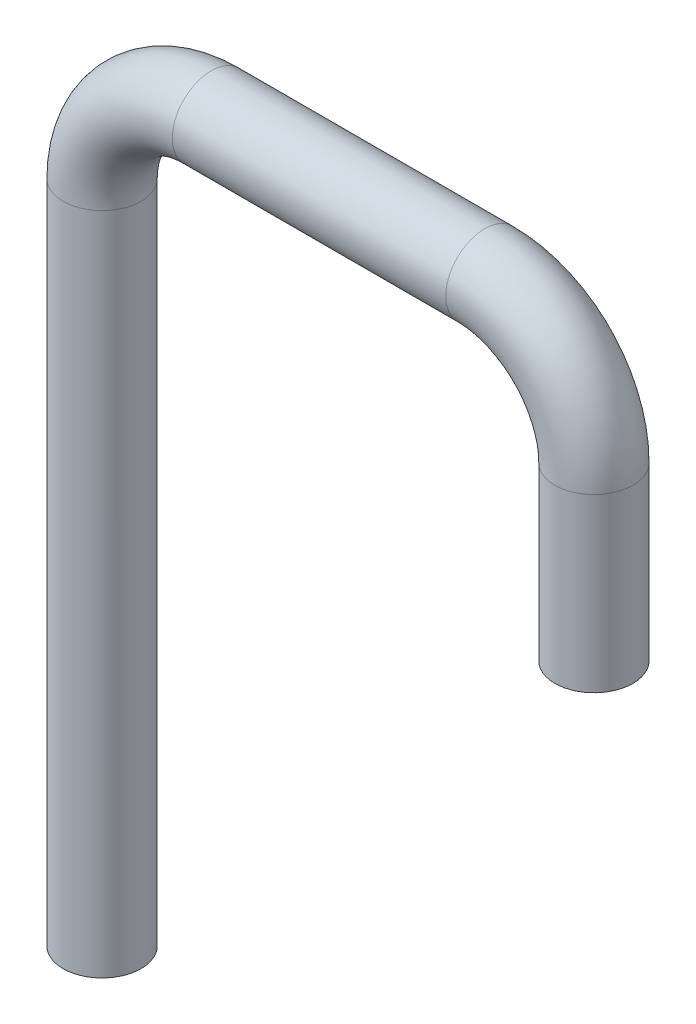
ISO-10303-21;
HEADER;
FILE_DESCRIPTION(('STEP AP214'),'2;1');
FILE_NAME('part.step','',(''),(''),'','','');
FILE_SCHEMA(('AUTOMOTIVE_DESIGN { 1 0 10303 214 1 1 1 1 }'));
ENDSEC;
DATA;
#1=APPLICATION_CONTEXT('core data for automotive mechanical design processes');
#2=APPLICATION_PROTOCOL_DEFINITION('international standard','automotive_design',2000,#1);
#3=PRODUCT_CONTEXT('',#1,'mechanical');
#4=PRODUCT('Part','Part','',(#3));
#5=PRODUCT_RELATED_PRODUCT_CATEGORY('part','',(#4));
#6=PRODUCT_DEFINITION_FORMATION('','',#4);
#7=PRODUCT_DEFINITION_CONTEXT('part definition',#1,'design');
#8=PRODUCT_DEFINITION('design','',#6,#7);
#9=PRODUCT_DEFINITION_SHAPE('','',#8);
#10=(LENGTH_UNIT() NAMED_UNIT(*) SI_UNIT(.MILLI.,.METRE.));
#11=(NAMED_UNIT(*) PLANE_ANGLE_UNIT() SI_UNIT($,.RADIAN.));
#12=(NAMED_UNIT(*) SI_UNIT($,.STERADIAN.) SOLID_ANGLE_UNIT());
#13=UNCERTAINTY_MEASURE_WITH_UNIT(LENGTH_MEASURE(1.E-05),#10,'distance_accuracy_value','');
#14=(GEOMETRIC_REPRESENTATION_CONTEXT(3) GLOBAL_UNCERTAINTY_ASSIGNED_CONTEXT((#13)) GLOBAL_UNIT_ASSIGNED_CONTEXT((#10,
#11,#12)) REPRESENTATION_CONTEXT('',''));
#15=CARTESIAN_POINT('',(0.,0.,0.));
#16=DIRECTION('',(0.,0.,1.));
#17=DIRECTION('',(1.,0.,0.));
#18=AXIS2_PLACEMENT_3D('',#15,#16,#17);
#19=CARTESIAN_POINT('',(40.0436780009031,54.102,0.));
#20=DIRECTION('',(0.,-1.,0.));
#21=DIRECTION('',(1.,0.,0.));
#22=AXIS2_PLACEMENT_3D('',#19,#20,#21);
#23=CYLINDRICAL_SURFACE('',#22,3.175);
#24=CARTESIAN_POINT('',(40.0436780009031,54.102,0.));
#25=DIRECTION('',(0.,-1.,0.));
#26=DIRECTION('',(1.,0.,0.));
#27=AXIS2_PLACEMENT_3D('',#24,#25,#26);
#28=CIRCLE('',#27,3.175);
#29=CARTESIAN_POINT('',(43.218678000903,54.102,-1.00118326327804E-13));
#30=VERTEX_POINT('',#29);
#31=EDGE_CURVE('E36',#30,#30,#28,.T.);
#32=ORIENTED_EDGE('',*,*,#31,.T.);
#33=EDGE_LOOP('',(#32));
#34=FACE_BOUND('',#33,.T.);
#35=CARTESIAN_POINT('',(40.0436780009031,40.132,-1.11022302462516E-13));
#36=DIRECTION('',(0.,-1.,0.));
#37=DIRECTION('',(1.,0.,0.));
#38=AXIS2_PLACEMENT_3D('',#35,#36,#37);
#39=CIRCLE('',#38,3.175);
#40=CARTESIAN_POINT('',(43.2186780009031,40.132,-1.09347947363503E-13));
#41=VERTEX_POINT('',#40);
#42=EDGE_CURVE('E10',#41,#41,#39,.T.);
#43=ORIENTED_EDGE('',*,*,#42,.F.);
#44=EDGE_LOOP('',(#43));
#45=FACE_BOUND('',#44,.T.);
#46=ADVANCED_FACE('F28',(#34,#45),#23,.T.);
#47=CARTESIAN_POINT('',(31.153678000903,54.102,0.));
#48=DIRECTION('',(0.,0.,-0.999999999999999));
#49=DIRECTION('',(-1.,0.,0.));
#50=AXIS2_PLACEMENT_3D('',#47,#48,#49);
#51=TOROIDAL_SURFACE('',#50,8.89000000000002,3.175);
#52=CARTESIAN_POINT('',(31.153678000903,62.992,0.));
#53=DIRECTION('',(-1.,0.,0.));
#54=DIRECTION('',(0.,-1.,0.));
#55=AXIS2_PLACEMENT_3D('',#52,#53,#54);
#56=CIRCLE('',#55,3.175);
#57=CARTESIAN_POINT('',(31.153678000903,66.167,-1.00118326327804E-13));
#58=VERTEX_POINT('',#57);
#59=EDGE_CURVE('E40',#58,#58,#56,.F.);
#60=CARTESIAN_POINT('',(31.153678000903,54.102,0.));
#61=DIRECTION('',(0.,0.,-0.999999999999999));
#62=DIRECTION('',(-1.,0.,0.));
#63=AXIS2_PLACEMENT_3D('',#60,#61,#62);
#64=CIRCLE('',#63,12.065);
#65=EDGE_CURVE('',#58,#30,#64,.T.);
#66=ORIENTED_EDGE('',*,*,#59,.T.);
#67=ORIENTED_EDGE('',*,*,#31,.F.);
#68=ORIENTED_EDGE('',*,*,#65,.T.);
#69=ORIENTED_EDGE('',*,*,#65,.F.);
#70=EDGE_LOOP('',(#66,#68,#67,#69));
#71=FACE_BOUND('',#70,.T.);
#72=ADVANCED_FACE('F110',(#71),#51,.T.);
#73=CARTESIAN_POINT('',(8.88999999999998,62.992,0.));
#74=DIRECTION('',(1.,0.,0.));
#75=DIRECTION('',(0.,1.,0.));
#76=AXIS2_PLACEMENT_3D('',#73,#74,#75);
#77=CYLINDRICAL_SURFACE('',#76,3.175);
#78=CARTESIAN_POINT('',(8.88999999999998,62.992,0.));
#79=DIRECTION('',(1.,0.,0.));
#80=DIRECTION('',(0.,1.,0.));
#81=AXIS2_PLACEMENT_3D('',#78,#79,#80);
#82=CIRCLE('',#81,3.175);
#83=CARTESIAN_POINT('',(8.88999999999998,66.167,0.));
#84=VERTEX_POINT('',#83);
#85=EDGE_CURVE('E46',#84,#84,#82,.T.);
#86=ORIENTED_EDGE('',*,*,#85,.T.);
#87=EDGE_LOOP('',(#86));
#88=FACE_BOUND('',#87,.T.);
#89=ORIENTED_EDGE('',*,*,#59,.F.);
#90=EDGE_LOOP('',(#89));
#91=FACE_BOUND('',#90,.T.);
#92=ADVANCED_FACE('F116',(#88,#91),#77,.T.);
#93=CARTESIAN_POINT('',(8.88999999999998,54.102,0.));
#94=DIRECTION('',(0.,0.,-0.999999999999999));
#95=DIRECTION('',(-1.,0.,0.));
#96=AXIS2_PLACEMENT_3D('',#93,#94,#95);
#97=TOROIDAL_SURFACE('',#96,8.89,3.175);
#98=CARTESIAN_POINT('',(0.,54.102,0.));
#99=DIRECTION('',(0.,-1.,0.));
#100=DIRECTION('',(0.,0.,-0.999999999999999));
#101=AXIS2_PLACEMENT_3D('',#98,#99,#100);
#102=CIRCLE('',#101,3.175);
#103=CARTESIAN_POINT('',(-3.17500000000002,54.102,0.));
#104=VERTEX_POINT('',#103);
#105=EDGE_CURVE('E43',#104,#104,#102,.F.);
#106=CARTESIAN_POINT('',(8.88999999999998,54.102,0.));
#107=DIRECTION('',(0.,0.,-0.999999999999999));
#108=DIRECTION('',(-1.,0.,0.));
#109=AXIS2_PLACEMENT_3D('',#106,#107,#108);
#110=CIRCLE('',#109,12.065);
#111=EDGE_CURVE('',#104,#84,#110,.T.);
#112=ORIENTED_EDGE('',*,*,#105,.T.);
#113=ORIENTED_EDGE('',*,*,#85,.F.);
#114=ORIENTED_EDGE('',*,*,#111,.T.);
#115=ORIENTED_EDGE('',*,*,#111,.F.);
#116=EDGE_LOOP('',(#112,#114,#113,#115));
#117=FACE_BOUND('',#116,.T.);
#118=ADVANCED_FACE('F107',(#117),#97,.T.);
#119=CARTESIAN_POINT('',(0.,54.102,0.));
#120=DIRECTION('',(0.,-1.,0.));
#121=DIRECTION('',(0.,0.,-0.999999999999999));
#122=AXIS2_PLACEMENT_3D('',#119,#120,#121);
#123=CYLINDRICAL_SURFACE('',#122,3.175);
#124=ORIENTED_EDGE('',*,*,#105,.F.);
#125=EDGE_LOOP('',(#124));
#126=FACE_BOUND('',#125,.T.);
#127=CARTESIAN_POINT('',(0.,0.,0.));
#128=DIRECTION('',(0.,1.,0.));
#129=DIRECTION('',(0.,0.,0.999999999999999));
#130=AXIS2_PLACEMENT_3D('',#127,#128,#129);
#131=CIRCLE('',#130,3.175);
#132=CARTESIAN_POINT('',(0.,0.,3.175));
#133=VERTEX_POINT('',#132);
#134=EDGE_CURVE('E32',#133,#133,#131,.T.);
#135=ORIENTED_EDGE('',*,*,#134,.T.);
#136=EDGE_LOOP('',(#135));
#137=FACE_BOUND('',#136,.T.);
#138=ADVANCED_FACE('F30',(#126,#137),#123,.T.);
#139=CARTESIAN_POINT('',(40.0436780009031,40.132,-1.11022302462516E-13));
#140=DIRECTION('',(0.,-1.,0.));
#141=DIRECTION('',(0.,0.,0.999999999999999));
#142=AXIS2_PLACEMENT_3D('',#139,#140,#141);
#143=PLANE('',#142);
#144=CARTESIAN_POINT('',(40.0436780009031,40.132,-1.11022302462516E-13));
#145=DIRECTION('',(0.,-1.,0.));
#146=DIRECTION('',(0.,0.,0.999999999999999));
#147=AXIS2_PLACEMENT_3D('',#144,#145,#146);
#148=CIRCLE('',#147,2.286);
#149=CARTESIAN_POINT('',(40.0436780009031,40.132,2.28599999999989));
#150=VERTEX_POINT('',#149);
#151=EDGE_CURVE('E51',#150,#150,#148,.T.);
#152=ORIENTED_EDGE('',*,*,#151,.F.);
#153=EDGE_LOOP('',(#152));
#154=FACE_BOUND('',#153,.T.);
#155=ORIENTED_EDGE('',*,*,#42,.T.);
#156=EDGE_LOOP('',(#155));
#157=FACE_BOUND('',#156,.T.);
#158=ADVANCED_FACE('F98',(#154,#157),#143,.T.);
#159=CARTESIAN_POINT('',(0.,0.,0.));
#160=DIRECTION('',(0.,1.,0.));
#161=DIRECTION('',(0.,0.,0.999999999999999));
#162=AXIS2_PLACEMENT_3D('',#159,#160,#161);
#163=PLANE('',#162);
#164=CARTESIAN_POINT('',(0.,0.,0.));
#165=DIRECTION('',(0.,1.,0.));
#166=DIRECTION('',(0.,0.,0.999999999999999));
#167=AXIS2_PLACEMENT_3D('',#164,#165,#166);
#168=CIRCLE('',#167,2.286);
#169=CARTESIAN_POINT('',(0.,0.,2.286));
#170=VERTEX_POINT('',#169);
#171=EDGE_CURVE('E64',#170,#170,#168,.T.);
#172=ORIENTED_EDGE('',*,*,#171,.T.);
#173=EDGE_LOOP('',(#172));
#174=FACE_BOUND('',#173,.T.);
#175=ORIENTED_EDGE('',*,*,#134,.F.);
#176=EDGE_LOOP('',(#175));
#177=FACE_BOUND('',#176,.T.);
#178=ADVANCED_FACE('F94',(#174,#177),#163,.F.);
#179=CARTESIAN_POINT('',(40.0436780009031,54.102,0.));
#180=DIRECTION('',(0.,-1.,0.));
#181=DIRECTION('',(1.,0.,0.));
#182=AXIS2_PLACEMENT_3D('',#179,#180,#181);
#183=CYLINDRICAL_SURFACE('',#182,2.286);
#184=CARTESIAN_POINT('',(40.0436780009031,54.102,0.));
#185=DIRECTION('',(0.,-1.,0.));
#186=DIRECTION('',(0.,0.,0.999999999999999));
#187=AXIS2_PLACEMENT_3D('',#184,#185,#186);
#188=CIRCLE('',#187,2.286);
#189=CARTESIAN_POINT('',(42.329678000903,54.102,0.));
#190=VERTEX_POINT('',#189);
#191=EDGE_CURVE('E54',#190,#190,#188,.T.);
#192=ORIENTED_EDGE('',*,*,#191,.F.);
#193=EDGE_LOOP('',(#192));
#194=FACE_BOUND('',#193,.T.);
#195=ORIENTED_EDGE('',*,*,#151,.T.);
#196=EDGE_LOOP('',(#195));
#197=FACE_BOUND('',#196,.T.);
#198=ADVANCED_FACE('F88',(#194,#197),#183,.F.);
#199=CARTESIAN_POINT('',(31.153678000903,54.102,0.));
#200=DIRECTION('',(0.,0.,-0.999999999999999));
#201=DIRECTION('',(-1.,0.,0.));
#202=AXIS2_PLACEMENT_3D('',#199,#200,#201);
#203=TOROIDAL_SURFACE('',#202,8.89000000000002,2.286);
#204=CARTESIAN_POINT('',(31.153678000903,62.992,0.));
#205=DIRECTION('',(1.,0.,0.));
#206=DIRECTION('',(0.,0.,0.999999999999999));
#207=AXIS2_PLACEMENT_3D('',#204,#205,#206);
#208=CIRCLE('',#207,2.286);
#209=CARTESIAN_POINT('',(31.153678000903,65.278,0.));
#210=VERTEX_POINT('',#209);
#211=EDGE_CURVE('E57',#210,#210,#208,.T.);
#212=CARTESIAN_POINT('',(31.153678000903,54.102,0.));
#213=DIRECTION('',(0.,0.,-0.999999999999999));
#214=DIRECTION('',(-1.,0.,0.));
#215=AXIS2_PLACEMENT_3D('',#212,#213,#214);
#216=CIRCLE('',#215,11.176);
#217=EDGE_CURVE('',#210,#190,#216,.T.);
#218=ORIENTED_EDGE('',*,*,#211,.F.);
#219=ORIENTED_EDGE('',*,*,#191,.T.);
#220=ORIENTED_EDGE('',*,*,#217,.T.);
#221=ORIENTED_EDGE('',*,*,#217,.F.);
#222=EDGE_LOOP('',(#218,#220,#219,#221));
#223=FACE_BOUND('',#222,.T.);
#224=ADVANCED_FACE('F82',(#223),#203,.F.);
#225=CARTESIAN_POINT('',(8.88999999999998,62.992,0.));
#226=DIRECTION('',(1.,0.,0.));
#227=DIRECTION('',(0.,1.,0.));
#228=AXIS2_PLACEMENT_3D('',#225,#226,#227);
#229=CYLINDRICAL_SURFACE('',#228,2.286);
#230=CARTESIAN_POINT('',(8.88999999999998,62.992,0.));
#231=DIRECTION('',(1.,0.,0.));
#232=DIRECTION('',(0.,0.,0.999999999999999));
#233=AXIS2_PLACEMENT_3D('',#230,#231,#232);
#234=CIRCLE('',#233,2.286);
#235=CARTESIAN_POINT('',(8.88999999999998,65.278,0.));
#236=VERTEX_POINT('',#235);
#237=EDGE_CURVE('E60',#236,#236,#234,.T.);
#238=ORIENTED_EDGE('',*,*,#237,.F.);
#239=EDGE_LOOP('',(#238));
#240=FACE_BOUND('',#239,.T.);
#241=ORIENTED_EDGE('',*,*,#211,.T.);
#242=EDGE_LOOP('',(#241));
#243=FACE_BOUND('',#242,.T.);
#244=ADVANCED_FACE('F76',(#240,#243),#229,.F.);
#245=CARTESIAN_POINT('',(8.88999999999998,54.102,0.));
#246=DIRECTION('',(0.,0.,-0.999999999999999));
#247=DIRECTION('',(-1.,0.,0.));
#248=AXIS2_PLACEMENT_3D('',#245,#246,#247);
#249=TOROIDAL_SURFACE('',#248,8.89,2.286);
#250=CARTESIAN_POINT('',(0.,54.102,0.));
#251=DIRECTION('',(0.,1.,0.));
#252=DIRECTION('',(0.,0.,0.999999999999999));
#253=AXIS2_PLACEMENT_3D('',#250,#251,#252);
#254=CIRCLE('',#253,2.286);
#255=CARTESIAN_POINT('',(-2.28600000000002,54.102,0.));
#256=VERTEX_POINT('',#255);
#257=EDGE_CURVE('E63',#256,#256,#254,.T.);
#258=CARTESIAN_POINT('',(8.88999999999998,54.102,0.));
#259=DIRECTION('',(0.,0.,-0.999999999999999));
#260=DIRECTION('',(-1.,0.,0.));
#261=AXIS2_PLACEMENT_3D('',#258,#259,#260);
#262=CIRCLE('',#261,11.176);
#263=EDGE_CURVE('',#256,#236,#262,.T.);
#264=ORIENTED_EDGE('',*,*,#257,.F.);
#265=ORIENTED_EDGE('',*,*,#237,.T.);
#266=ORIENTED_EDGE('',*,*,#263,.T.);
#267=ORIENTED_EDGE('',*,*,#263,.F.);
#268=EDGE_LOOP('',(#264,#266,#265,#267));
#269=FACE_BOUND('',#268,.T.);
#270=ADVANCED_FACE('F73',(#269),#249,.F.);
#271=CARTESIAN_POINT('',(0.,54.102,0.));
#272=DIRECTION('',(0.,-1.,0.));
#273=DIRECTION('',(0.,0.,-0.999999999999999));
#274=AXIS2_PLACEMENT_3D('',#271,#272,#273);
#275=CYLINDRICAL_SURFACE('',#274,2.286);
#276=ORIENTED_EDGE('',*,*,#257,.T.);
#277=EDGE_LOOP('',(#276));
#278=FACE_BOUND('',#277,.T.);
#279=ORIENTED_EDGE('',*,*,#171,.F.);
#280=EDGE_LOOP('',(#279));
#281=FACE_BOUND('',#280,.T.);
#282=ADVANCED_FACE('F70',(#278,#281),#275,.F.);
#283=CLOSED_SHELL('',(#46,#72,#92,#118,#138,#158,#178,#198,#224,#244,#270,#282));
#284=MANIFOLD_SOLID_BREP('B2',#283);
#285=ADVANCED_BREP_SHAPE_REPRESENTATION('',(#18,#284),#14);
#286=SHAPE_DEFINITION_REPRESENTATION(#9,#285);
ENDSEC;
END-ISO-10303-21;
